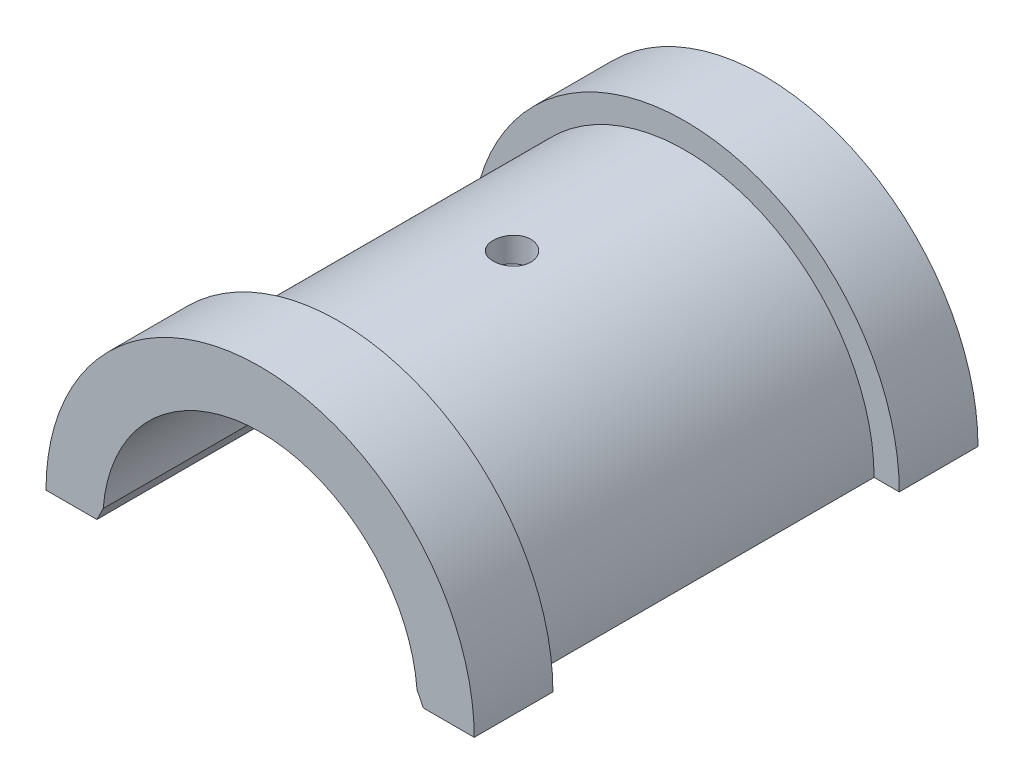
ISO-10303-21;
HEADER;
FILE_DESCRIPTION(('STEP AP214'),'2;1');
FILE_NAME('part.step','',(''),(''),'','','');
FILE_SCHEMA(('AUTOMOTIVE_DESIGN { 1 0 10303 214 1 1 1 1 }'));
ENDSEC;
DATA;
#1=APPLICATION_CONTEXT('core data for automotive mechanical design processes');
#2=APPLICATION_PROTOCOL_DEFINITION('international standard','automotive_design',2000,#1);
#3=PRODUCT_CONTEXT('',#1,'mechanical');
#4=PRODUCT('Part','Part','',(#3));
#5=PRODUCT_RELATED_PRODUCT_CATEGORY('part','',(#4));
#6=PRODUCT_DEFINITION_FORMATION('','',#4);
#7=PRODUCT_DEFINITION_CONTEXT('part definition',#1,'design');
#8=PRODUCT_DEFINITION('design','',#6,#7);
#9=PRODUCT_DEFINITION_SHAPE('','',#8);
#10=(LENGTH_UNIT() NAMED_UNIT(*) SI_UNIT(.MILLI.,.METRE.));
#11=(NAMED_UNIT(*) PLANE_ANGLE_UNIT() SI_UNIT($,.RADIAN.));
#12=(NAMED_UNIT(*) SI_UNIT($,.STERADIAN.) SOLID_ANGLE_UNIT());
#13=UNCERTAINTY_MEASURE_WITH_UNIT(LENGTH_MEASURE(1.E-05),#10,'distance_accuracy_value','');
#14=(GEOMETRIC_REPRESENTATION_CONTEXT(3) GLOBAL_UNCERTAINTY_ASSIGNED_CONTEXT((#13)) GLOBAL_UNIT_ASSIGNED_CONTEXT((#10,
#11,#12)) REPRESENTATION_CONTEXT('',''));
#15=CARTESIAN_POINT('',(0.,0.,0.));
#16=DIRECTION('',(0.,0.,1.));
#17=DIRECTION('',(1.,0.,0.));
#18=AXIS2_PLACEMENT_3D('',#15,#16,#17);
#19=CARTESIAN_POINT('',(0.,70.,40.));
#20=DIRECTION('',(0.,0.,-1.));
#21=DIRECTION('',(-1.,0.,0.));
#22=AXIS2_PLACEMENT_3D('',#19,#20,#21);
#23=CYLINDRICAL_SURFACE('',#22,25.);
#24=DIRECTION('',(0.,0.,1.));
#25=VECTOR('',#24,1.);
#26=CARTESIAN_POINT('',(24.9198715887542,72.,-40.));
#27=LINE('',#26,#25);
#28=CARTESIAN_POINT('',(24.9198715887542,72.,-40.));
#29=VERTEX_POINT('',#28);
#30=CARTESIAN_POINT('',(24.9198715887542,72.,40.));
#31=VERTEX_POINT('',#30);
#32=EDGE_CURVE('E51',#29,#31,#27,.T.);
#33=ORIENTED_EDGE('',*,*,#32,.T.);
#34=CARTESIAN_POINT('',(0.,70.,40.));
#35=DIRECTION('',(0.,0.,-1.));
#36=DIRECTION('',(-1.,0.,0.));
#37=AXIS2_PLACEMENT_3D('',#34,#35,#36);
#38=CIRCLE('',#37,25.);
#39=CARTESIAN_POINT('',(-24.9198715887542,72.,40.));
#40=VERTEX_POINT('',#39);
#41=EDGE_CURVE('E139',#40,#31,#38,.T.);
#42=ORIENTED_EDGE('',*,*,#41,.F.);
#43=DIRECTION('',(0.,0.,1.));
#44=VECTOR('',#43,1.);
#45=CARTESIAN_POINT('',(-24.9198715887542,72.,-40.));
#46=LINE('',#45,#44);
#47=CARTESIAN_POINT('',(-24.9198715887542,72.,-40.));
#48=VERTEX_POINT('',#47);
#49=EDGE_CURVE('E187',#48,#40,#46,.T.);
#50=ORIENTED_EDGE('',*,*,#49,.F.);
#51=CARTESIAN_POINT('',(0.,70.,-40.));
#52=DIRECTION('',(0.,0.,-1.));
#53=DIRECTION('',(-1.,0.,0.));
#54=AXIS2_PLACEMENT_3D('',#51,#52,#53);
#55=CIRCLE('',#54,25.);
#56=EDGE_CURVE('E136',#48,#29,#55,.T.);
#57=ORIENTED_EDGE('',*,*,#56,.T.);
#58=EDGE_LOOP('',(#33,#42,#50,#57));
#59=FACE_BOUND('',#58,.T.);
#60=ADVANCED_FACE('F31',(#59),#23,.F.);
#61=CARTESIAN_POINT('',(25.,70.,40.));
#62=DIRECTION('',(0.,1.,0.));
#63=DIRECTION('',(0.,0.,1.));
#64=AXIS2_PLACEMENT_3D('',#61,#62,#63);
#65=PLANE('',#64);
#66=DIRECTION('',(0.,0.,1.));
#67=VECTOR('',#66,1.);
#68=CARTESIAN_POINT('',(25.9198715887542,70.,-40.));
#69=LINE('',#68,#67);
#70=CARTESIAN_POINT('',(25.9198715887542,70.,-40.));
#71=VERTEX_POINT('',#70);
#72=CARTESIAN_POINT('',(25.9198715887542,70.,40.));
#73=VERTEX_POINT('',#72);
#74=EDGE_CURVE('E113',#71,#73,#69,.T.);
#75=ORIENTED_EDGE('',*,*,#74,.F.);
#76=DIRECTION('',(1.,0.,0.));
#77=VECTOR('',#76,1.);
#78=CARTESIAN_POINT('',(25.,70.,-40.));
#79=LINE('',#78,#77);
#80=CARTESIAN_POINT('',(34.,70.,-40.));
#81=VERTEX_POINT('',#80);
#82=EDGE_CURVE('E125',#71,#81,#79,.T.);
#83=ORIENTED_EDGE('',*,*,#82,.T.);
#84=DIRECTION('',(0.,0.,-1.));
#85=VECTOR('',#84,1.);
#86=CARTESIAN_POINT('',(34.,70.,48.5263112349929));
#87=LINE('',#86,#85);
#88=CARTESIAN_POINT('',(34.,70.,-27.5));
#89=VERTEX_POINT('',#88);
#90=EDGE_CURVE('E181',#89,#81,#87,.T.);
#91=ORIENTED_EDGE('',*,*,#90,.F.);
#92=DIRECTION('',(1.,0.,0.));
#93=VECTOR('',#92,1.);
#94=CARTESIAN_POINT('',(25.,70.,-27.5));
#95=LINE('',#94,#93);
#96=CARTESIAN_POINT('',(30.,70.,-27.5));
#97=VERTEX_POINT('',#96);
#98=EDGE_CURVE('E178',#97,#89,#95,.T.);
#99=ORIENTED_EDGE('',*,*,#98,.F.);
#100=DIRECTION('',(0.,0.,-1.));
#101=VECTOR('',#100,1.);
#102=CARTESIAN_POINT('',(30.,70.,40.));
#103=LINE('',#102,#101);
#104=CARTESIAN_POINT('',(30.,70.,27.5));
#105=VERTEX_POINT('',#104);
#106=EDGE_CURVE('E44',#105,#97,#103,.T.);
#107=ORIENTED_EDGE('',*,*,#106,.F.);
#108=DIRECTION('',(1.,0.,0.));
#109=VECTOR('',#108,1.);
#110=CARTESIAN_POINT('',(34.,70.,27.5));
#111=LINE('',#110,#109);
#112=CARTESIAN_POINT('',(34.,70.,27.5));
#113=VERTEX_POINT('',#112);
#114=EDGE_CURVE('E168',#105,#113,#111,.T.);
#115=ORIENTED_EDGE('',*,*,#114,.T.);
#116=DIRECTION('',(0.,0.,1.));
#117=VECTOR('',#116,1.);
#118=CARTESIAN_POINT('',(34.,70.,-48.5263112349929));
#119=LINE('',#118,#117);
#120=CARTESIAN_POINT('',(34.,70.,40.));
#121=VERTEX_POINT('',#120);
#122=EDGE_CURVE('E165',#113,#121,#119,.T.);
#123=ORIENTED_EDGE('',*,*,#122,.T.);
#124=DIRECTION('',(1.,0.,0.));
#125=VECTOR('',#124,1.);
#126=CARTESIAN_POINT('',(25.,70.,40.));
#127=LINE('',#126,#125);
#128=EDGE_CURVE('E128',#73,#121,#127,.T.);
#129=ORIENTED_EDGE('',*,*,#128,.F.);
#130=EDGE_LOOP('',(#75,#83,#91,#99,#107,#115,#123,#129));
#131=FACE_BOUND('',#130,.T.);
#132=ADVANCED_FACE('F123',(#131),#65,.F.);
#133=CARTESIAN_POINT('',(0.,70.,40.));
#134=DIRECTION('',(0.,0.,-1.));
#135=DIRECTION('',(-1.,0.,0.));
#136=AXIS2_PLACEMENT_3D('',#133,#134,#135);
#137=PLANE('',#136);
#138=DIRECTION('',(0.447213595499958,-0.894427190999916,0.));
#139=VECTOR('',#138,1.);
#140=CARTESIAN_POINT('',(24.9198715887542,72.,40.));
#141=LINE('',#140,#139);
#142=EDGE_CURVE('E119',#31,#73,#141,.T.);
#143=ORIENTED_EDGE('',*,*,#142,.T.);
#144=ORIENTED_EDGE('',*,*,#128,.T.);
#145=CARTESIAN_POINT('',(0.,70.,40.));
#146=DIRECTION('',(0.,0.,1.));
#147=DIRECTION('',(-1.,0.,0.));
#148=AXIS2_PLACEMENT_3D('',#145,#146,#147);
#149=CIRCLE('',#148,34.);
#150=CARTESIAN_POINT('',(-34.,70.,40.));
#151=VERTEX_POINT('',#150);
#152=EDGE_CURVE('E174',#121,#151,#149,.T.);
#153=ORIENTED_EDGE('',*,*,#152,.T.);
#154=DIRECTION('',(1.,0.,0.));
#155=VECTOR('',#154,1.);
#156=CARTESIAN_POINT('',(-30.,70.,40.));
#157=LINE('',#156,#155);
#158=CARTESIAN_POINT('',(-25.9198715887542,70.,40.));
#159=VERTEX_POINT('',#158);
#160=EDGE_CURVE('E135',#151,#159,#157,.T.);
#161=ORIENTED_EDGE('',*,*,#160,.T.);
#162=DIRECTION('',(-0.447213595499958,-0.894427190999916,0.));
#163=VECTOR('',#162,1.);
#164=CARTESIAN_POINT('',(-24.9198715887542,72.,40.));
#165=LINE('',#164,#163);
#166=EDGE_CURVE('E129',#40,#159,#165,.T.);
#167=ORIENTED_EDGE('',*,*,#166,.F.);
#168=ORIENTED_EDGE('',*,*,#41,.T.);
#169=EDGE_LOOP('',(#143,#144,#153,#161,#167,#168));
#170=FACE_BOUND('',#169,.T.);
#171=ADVANCED_FACE('F224',(#170),#137,.F.);
#172=CARTESIAN_POINT('',(0.,70.,-40.));
#173=DIRECTION('',(0.,0.,-1.));
#174=DIRECTION('',(-1.,0.,0.));
#175=AXIS2_PLACEMENT_3D('',#172,#173,#174);
#176=PLANE('',#175);
#177=ORIENTED_EDGE('',*,*,#82,.F.);
#178=DIRECTION('',(0.447213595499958,-0.894427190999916,0.));
#179=VECTOR('',#178,1.);
#180=CARTESIAN_POINT('',(24.9198715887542,72.,-40.));
#181=LINE('',#180,#179);
#182=EDGE_CURVE('E110',#29,#71,#181,.T.);
#183=ORIENTED_EDGE('',*,*,#182,.F.);
#184=ORIENTED_EDGE('',*,*,#56,.F.);
#185=DIRECTION('',(-0.447213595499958,-0.894427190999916,0.));
#186=VECTOR('',#185,1.);
#187=CARTESIAN_POINT('',(-24.9198715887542,72.,-40.));
#188=LINE('',#187,#186);
#189=CARTESIAN_POINT('',(-25.9198715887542,70.,-40.));
#190=VERTEX_POINT('',#189);
#191=EDGE_CURVE('E192',#48,#190,#188,.T.);
#192=ORIENTED_EDGE('',*,*,#191,.T.);
#193=DIRECTION('',(1.,0.,0.));
#194=VECTOR('',#193,1.);
#195=CARTESIAN_POINT('',(-30.,70.,-40.));
#196=LINE('',#195,#194);
#197=CARTESIAN_POINT('',(-34.,70.,-40.));
#198=VERTEX_POINT('',#197);
#199=EDGE_CURVE('E141',#198,#190,#196,.T.);
#200=ORIENTED_EDGE('',*,*,#199,.F.);
#201=CARTESIAN_POINT('',(0.,70.,-40.));
#202=DIRECTION('',(0.,0.,-1.));
#203=DIRECTION('',(-1.,0.,0.));
#204=AXIS2_PLACEMENT_3D('',#201,#202,#203);
#205=CIRCLE('',#204,34.);
#206=EDGE_CURVE('E134',#198,#81,#205,.T.);
#207=ORIENTED_EDGE('',*,*,#206,.T.);
#208=EDGE_LOOP('',(#177,#183,#184,#192,#200,#207));
#209=FACE_BOUND('',#208,.T.);
#210=ADVANCED_FACE('F132',(#209),#176,.T.);
#211=CARTESIAN_POINT('',(0.,70.,40.));
#212=DIRECTION('',(0.,0.,-1.));
#213=DIRECTION('',(-1.,0.,0.));
#214=AXIS2_PLACEMENT_3D('',#211,#212,#213);
#215=CYLINDRICAL_SURFACE('',#214,30.);
#216=CARTESIAN_POINT('',(-3.,99.8496231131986,0.));
#217=CARTESIAN_POINT('',(-2.99999272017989,99.8496250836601,-0.168058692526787));
#218=CARTESIAN_POINT('',(-2.98583057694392,99.8510577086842,-0.336228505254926));
#219=CARTESIAN_POINT('',(-2.92954894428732,99.856632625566,-0.667905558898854));
#220=CARTESIAN_POINT('',(-2.88739864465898,99.8607779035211,-0.831407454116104));
#221=CARTESIAN_POINT('',(-2.77638034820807,99.8713039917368,-1.14889745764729));
#222=CARTESIAN_POINT('',(-2.70752854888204,99.8776834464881,-1.3028912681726));
#223=CARTESIAN_POINT('',(-2.54509280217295,99.8919574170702,-1.59710337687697));
#224=CARTESIAN_POINT('',(-2.45151376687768,99.8998516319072,-1.73732440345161));
#225=CARTESIAN_POINT('',(-2.2419142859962,99.9162978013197,-2.00055379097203));
#226=CARTESIAN_POINT('',(-2.1258222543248,99.9248518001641,-2.12350502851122));
#227=CARTESIAN_POINT('',(-1.87464514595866,99.9416351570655,-2.34821282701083));
#228=CARTESIAN_POINT('',(-1.7395592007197,99.9498645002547,-2.44996841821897));
#229=CARTESIAN_POINT('',(-1.45387908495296,99.9650914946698,-2.62959377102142));
#230=CARTESIAN_POINT('',(-1.30325298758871,99.9720865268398,-2.70741299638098));
#231=CARTESIAN_POINT('',(-0.990989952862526,99.9840345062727,-2.83663329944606));
#232=CARTESIAN_POINT('',(-0.829353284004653,99.9889875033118,-2.88803502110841));
#233=CARTESIAN_POINT('',(-0.500234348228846,99.9962789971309,-2.96279372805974));
#234=CARTESIAN_POINT('',(-0.332773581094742,99.9986262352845,-2.98624449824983));
#235=CARTESIAN_POINT('',(0.0037222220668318,100.000471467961,-3.00472580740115));
#236=CARTESIAN_POINT('',(0.172757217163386,99.9999695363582,-2.99975708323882));
#237=CARTESIAN_POINT('',(0.506966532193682,99.9961801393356,-2.96161658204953));
#238=CARTESIAN_POINT('',(0.672152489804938,99.9929026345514,-2.92854565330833));
#239=CARTESIAN_POINT('',(0.9946175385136,99.9839418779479,-2.83529661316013));
#240=CARTESIAN_POINT('',(1.15189652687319,99.9782585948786,-2.77511814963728));
#241=CARTESIAN_POINT('',(1.45440094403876,99.9651081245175,-2.62925171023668));
#242=CARTESIAN_POINT('',(1.59960471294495,99.9576378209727,-2.54351910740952));
#243=CARTESIAN_POINT('',(1.87360053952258,99.9417515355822,-2.34901042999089));
#244=CARTESIAN_POINT('',(2.00239211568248,99.9333355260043,-2.24023367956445));
#245=CARTESIAN_POINT('',(2.24049831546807,99.9164588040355,-2.00215731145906));
#246=CARTESIAN_POINT('',(2.34972523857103,99.9079980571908,-1.87276996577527));
#247=CARTESIAN_POINT('',(2.54492260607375,99.8920221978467,-1.59744940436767));
#248=CARTESIAN_POINT('',(2.63089301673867,99.8845070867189,-1.45151616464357));
#249=CARTESIAN_POINT('',(2.77713655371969,99.8712726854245,-1.14717892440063));
#250=CARTESIAN_POINT('',(2.83740426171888,99.8655537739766,-0.988772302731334));
#251=CARTESIAN_POINT('',(2.93046220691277,99.8565670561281,-0.664018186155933));
#252=CARTESIAN_POINT('',(2.9632532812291,99.8532991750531,-0.497670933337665));
#253=CARTESIAN_POINT('',(3.00031432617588,99.8495974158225,-0.162527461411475));
#254=CARTESIAN_POINT('',(3.00470698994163,99.8491513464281,0.00625506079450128));
#255=CARTESIAN_POINT('',(2.98516874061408,99.8511115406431,0.34215379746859));
#256=CARTESIAN_POINT('',(2.96123821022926,99.8535177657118,0.509270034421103));
#257=CARTESIAN_POINT('',(2.88583552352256,99.8609003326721,0.836734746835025));
#258=CARTESIAN_POINT('',(2.83442138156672,99.8658712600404,0.997096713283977));
#259=CARTESIAN_POINT('',(2.70557015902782,99.8778187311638,1.30692015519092));
#260=CARTESIAN_POINT('',(2.62813248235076,99.8847953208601,1.45638138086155));
#261=CARTESIAN_POINT('',(2.44912500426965,99.8999975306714,1.74071992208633));
#262=CARTESIAN_POINT('',(2.34747389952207,99.9082273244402,1.87554582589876));
#263=CARTESIAN_POINT('',(2.12304160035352,99.9249949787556,2.12626515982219));
#264=CARTESIAN_POINT('',(2.0002598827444,99.933532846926,2.24215812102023));
#265=CARTESIAN_POINT('',(1.73651941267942,99.9499914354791,2.45214490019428));
#266=CARTESIAN_POINT('',(1.59549676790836,99.9579098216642,2.54615867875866));
#267=CARTESIAN_POINT('',(1.29959315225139,99.9722032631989,2.70916760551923));
#268=CARTESIAN_POINT('',(1.14471237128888,99.9785783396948,2.77816309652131));
#269=CARTESIAN_POINT('',(0.825768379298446,99.9890563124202,2.889041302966));
#270=CARTESIAN_POINT('',(0.661722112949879,99.9931632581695,2.93097236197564));
#271=CARTESIAN_POINT('',(0.328874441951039,99.9986588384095,2.98668920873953));
#272=CARTESIAN_POINT('',(0.160073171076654,100.000047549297,3.00047578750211));
#273=CARTESIAN_POINT('',(-0.176706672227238,99.9999501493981,2.99950120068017));
#274=CARTESIAN_POINT('',(-0.344685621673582,99.9984765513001,2.98486428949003));
#275=CARTESIAN_POINT('',(-0.675785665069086,99.9928448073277,2.92771876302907));
#276=CARTESIAN_POINT('',(-0.838906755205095,99.9886866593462,2.88521012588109));
#277=CARTESIAN_POINT('',(-1.15565972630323,99.9781517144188,2.7735622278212));
#278=CARTESIAN_POINT('',(-1.30929289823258,99.9717752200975,2.70442659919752));
#279=CARTESIAN_POINT('',(-1.60279380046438,99.9575143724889,2.54150049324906));
#280=CARTESIAN_POINT('',(-1.74266161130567,99.9496300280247,2.44771016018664));
#281=CARTESIAN_POINT('',(-2.00529817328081,99.9331955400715,2.23767114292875));
#282=CARTESIAN_POINT('',(-2.12799277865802,99.9246427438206,2.1213299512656));
#283=CARTESIAN_POINT('',(-2.35217327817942,99.9078577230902,1.86967394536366));
#284=CARTESIAN_POINT('',(-2.45365407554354,99.8996255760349,1.73435458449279));
#285=CARTESIAN_POINT('',(-2.63272992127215,99.8843915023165,1.44820697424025));
#286=CARTESIAN_POINT('',(-2.71026356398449,99.8773927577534,1.29734015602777));
#287=CARTESIAN_POINT('',(-2.83879412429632,99.8654558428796,0.984755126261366));
#288=CARTESIAN_POINT('',(-2.88982097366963,99.8605153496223,0.823049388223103));
#289=CARTESIAN_POINT('',(-2.95116506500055,99.8545002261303,0.550356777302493));
#290=CARTESIAN_POINT('',(-2.96945313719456,99.8526799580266,0.441113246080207));
#291=CARTESIAN_POINT('',(-2.99387297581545,99.8502407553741,0.221262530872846));
#292=CARTESIAN_POINT('',(-3.00000479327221,99.8496218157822,0.110655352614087));
#293=CARTESIAN_POINT('',(-3.,99.8496231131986,0.));
#294=B_SPLINE_CURVE_WITH_KNOTS('',3,(#216,#217,#218,#219,#220,#221,#222,#223,#224,#225,#226,
#227,#228,#229,#230,#231,#232,#233,#234,#235,#236,#237,#238,#239,#240,#241,#242,#243,#244,#245,
#246,#247,#248,#249,#250,#251,#252,#253,#254,#255,#256,#257,#258,#259,#260,#261,#262,#263,#264,
#265,#266,#267,#268,#269,#270,#271,#272,#273,#274,#275,#276,#277,#278,#279,#280,#281,#282,#283,
#284,#285,#286,#287,#288,#289,#290,#291,#292,#293),.UNSPECIFIED.,.T.,.F.,(4,2,2,2,2,2,2,2,2,2,2,
2,2,2,2,2,2,2,2,2,2,2,2,2,2,2,2,2,2,2,2,2,2,2,2,2,2,2,4),(0.,0.503771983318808,1.00809945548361,
1.51212147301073,2.01604344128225,2.52159484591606,3.02716937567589,3.53380409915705,
4.04042647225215,4.54534412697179,5.05024868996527,5.55334895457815,6.05645575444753,
6.56044636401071,7.06445175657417,7.57066275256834,8.07687448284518,8.58319287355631,
9.08949583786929,9.59360988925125,10.0977171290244,10.6007644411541,11.1038232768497,
11.6085956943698,12.1133806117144,12.6199841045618,13.1265806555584,13.6322697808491,
14.1379446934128,14.6414140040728,15.144883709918,15.6482847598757,16.1516828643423,
16.6571914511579,17.162821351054,17.6697372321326,18.1760794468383,18.5077808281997,
18.8394808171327),.UNSPECIFIED.);
#295=CARTESIAN_POINT('',(-3.,99.8496231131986,0.));
#296=VERTEX_POINT('',#295);
#297=EDGE_CURVE('E36',#296,#296,#294,.T.);
#298=ORIENTED_EDGE('',*,*,#297,.T.);
#299=EDGE_LOOP('',(#298));
#300=FACE_BOUND('',#299,.T.);
#301=CARTESIAN_POINT('',(0.,70.,-27.5));
#302=DIRECTION('',(0.,0.,-1.));
#303=DIRECTION('',(-1.,0.,0.));
#304=AXIS2_PLACEMENT_3D('',#301,#302,#303);
#305=CIRCLE('',#304,30.);
#306=CARTESIAN_POINT('',(-30.,70.,-27.5));
#307=VERTEX_POINT('',#306);
#308=EDGE_CURVE('E176',#307,#97,#305,.T.);
#309=ORIENTED_EDGE('',*,*,#308,.F.);
#310=DIRECTION('',(0.,0.,-1.));
#311=VECTOR('',#310,1.);
#312=CARTESIAN_POINT('',(-30.,70.,40.));
#313=LINE('',#312,#311);
#314=CARTESIAN_POINT('',(-30.,70.,27.5));
#315=VERTEX_POINT('',#314);
#316=EDGE_CURVE('E11',#315,#307,#313,.T.);
#317=ORIENTED_EDGE('',*,*,#316,.F.);
#318=CARTESIAN_POINT('',(0.,70.,27.5));
#319=DIRECTION('',(0.,0.,-1.));
#320=DIRECTION('',(-1.,0.,0.));
#321=AXIS2_PLACEMENT_3D('',#318,#319,#320);
#322=CIRCLE('',#321,30.);
#323=EDGE_CURVE('E155',#315,#105,#322,.T.);
#324=ORIENTED_EDGE('',*,*,#323,.T.);
#325=ORIENTED_EDGE('',*,*,#106,.T.);
#326=EDGE_LOOP('',(#309,#317,#324,#325));
#327=FACE_BOUND('',#326,.T.);
#328=ADVANCED_FACE('F33',(#300,#327),#215,.T.);
#329=CARTESIAN_POINT('',(-30.,70.,40.));
#330=DIRECTION('',(0.,1.,0.));
#331=DIRECTION('',(0.,0.,1.));
#332=AXIS2_PLACEMENT_3D('',#329,#330,#331);
#333=PLANE('',#332);
#334=ORIENTED_EDGE('',*,*,#199,.T.);
#335=DIRECTION('',(0.,0.,1.));
#336=VECTOR('',#335,1.);
#337=CARTESIAN_POINT('',(-25.9198715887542,70.,-40.));
#338=LINE('',#337,#336);
#339=EDGE_CURVE('E59',#190,#159,#338,.T.);
#340=ORIENTED_EDGE('',*,*,#339,.T.);
#341=ORIENTED_EDGE('',*,*,#160,.F.);
#342=DIRECTION('',(0.,0.,1.));
#343=VECTOR('',#342,1.);
#344=CARTESIAN_POINT('',(-34.,70.,-48.5263112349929));
#345=LINE('',#344,#343);
#346=CARTESIAN_POINT('',(-34.,70.,27.5));
#347=VERTEX_POINT('',#346);
#348=EDGE_CURVE('E162',#347,#151,#345,.T.);
#349=ORIENTED_EDGE('',*,*,#348,.F.);
#350=DIRECTION('',(1.,0.,0.));
#351=VECTOR('',#350,1.);
#352=CARTESIAN_POINT('',(-25.,70.,27.5));
#353=LINE('',#352,#351);
#354=EDGE_CURVE('E158',#347,#315,#353,.T.);
#355=ORIENTED_EDGE('',*,*,#354,.T.);
#356=ORIENTED_EDGE('',*,*,#316,.T.);
#357=DIRECTION('',(1.,0.,0.));
#358=VECTOR('',#357,1.);
#359=CARTESIAN_POINT('',(-34.,70.,-27.5));
#360=LINE('',#359,#358);
#361=CARTESIAN_POINT('',(-34.,70.,-27.5));
#362=VERTEX_POINT('',#361);
#363=EDGE_CURVE('E185',#362,#307,#360,.T.);
#364=ORIENTED_EDGE('',*,*,#363,.F.);
#365=DIRECTION('',(0.,0.,-1.));
#366=VECTOR('',#365,1.);
#367=CARTESIAN_POINT('',(-34.,70.,48.5263112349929));
#368=LINE('',#367,#366);
#369=EDGE_CURVE('E183',#362,#198,#368,.T.);
#370=ORIENTED_EDGE('',*,*,#369,.T.);
#371=EDGE_LOOP('',(#334,#340,#341,#349,#355,#356,#364,#370));
#372=FACE_BOUND('',#371,.T.);
#373=ADVANCED_FACE('F227',(#372),#333,.F.);
#374=CARTESIAN_POINT('',(0.,70.,27.5));
#375=DIRECTION('',(0.,0.,-1.));
#376=DIRECTION('',(-1.,0.,0.));
#377=AXIS2_PLACEMENT_3D('',#374,#375,#376);
#378=PLANE('',#377);
#379=ORIENTED_EDGE('',*,*,#323,.F.);
#380=ORIENTED_EDGE('',*,*,#354,.F.);
#381=CARTESIAN_POINT('',(0.,70.,27.5));
#382=DIRECTION('',(0.,0.,-1.));
#383=DIRECTION('',(-1.,0.,0.));
#384=AXIS2_PLACEMENT_3D('',#381,#382,#383);
#385=CIRCLE('',#384,34.);
#386=EDGE_CURVE('E167',#113,#347,#385,.F.);
#387=ORIENTED_EDGE('',*,*,#386,.F.);
#388=ORIENTED_EDGE('',*,*,#114,.F.);
#389=EDGE_LOOP('',(#379,#380,#387,#388));
#390=FACE_BOUND('',#389,.T.);
#391=ADVANCED_FACE('F229',(#390),#378,.T.);
#392=CARTESIAN_POINT('',(0.,70.,-48.5263112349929));
#393=DIRECTION('',(0.,0.,1.));
#394=DIRECTION('',(1.,0.,0.));
#395=AXIS2_PLACEMENT_3D('',#392,#393,#394);
#396=CYLINDRICAL_SURFACE('',#395,34.);
#397=ORIENTED_EDGE('',*,*,#122,.F.);
#398=ORIENTED_EDGE('',*,*,#386,.T.);
#399=ORIENTED_EDGE('',*,*,#348,.T.);
#400=ORIENTED_EDGE('',*,*,#152,.F.);
#401=EDGE_LOOP('',(#397,#398,#399,#400));
#402=FACE_BOUND('',#401,.T.);
#403=ADVANCED_FACE('F234',(#402),#396,.T.);
#404=CARTESIAN_POINT('',(0.,70.,-27.5));
#405=DIRECTION('',(0.,0.,-1.));
#406=DIRECTION('',(-1.,0.,0.));
#407=AXIS2_PLACEMENT_3D('',#404,#405,#406);
#408=PLANE('',#407);
#409=ORIENTED_EDGE('',*,*,#363,.T.);
#410=ORIENTED_EDGE('',*,*,#308,.T.);
#411=ORIENTED_EDGE('',*,*,#98,.T.);
#412=CARTESIAN_POINT('',(0.,70.,-27.5));
#413=DIRECTION('',(0.,0.,-1.));
#414=DIRECTION('',(-1.,0.,0.));
#415=AXIS2_PLACEMENT_3D('',#412,#413,#414);
#416=CIRCLE('',#415,34.);
#417=EDGE_CURVE('E180',#89,#362,#416,.F.);
#418=ORIENTED_EDGE('',*,*,#417,.T.);
#419=EDGE_LOOP('',(#409,#410,#411,#418));
#420=FACE_BOUND('',#419,.T.);
#421=ADVANCED_FACE('F247',(#420),#408,.F.);
#422=CARTESIAN_POINT('',(0.,70.,48.5263112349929));
#423=DIRECTION('',(0.,0.,-1.));
#424=DIRECTION('',(-1.,0.,0.));
#425=AXIS2_PLACEMENT_3D('',#422,#423,#424);
#426=CYLINDRICAL_SURFACE('',#425,34.);
#427=ORIENTED_EDGE('',*,*,#417,.F.);
#428=ORIENTED_EDGE('',*,*,#90,.T.);
#429=ORIENTED_EDGE('',*,*,#206,.F.);
#430=ORIENTED_EDGE('',*,*,#369,.F.);
#431=EDGE_LOOP('',(#427,#428,#429,#430));
#432=FACE_BOUND('',#431,.T.);
#433=ADVANCED_FACE('F249',(#432),#426,.T.);
#434=CARTESIAN_POINT('',(-24.9198715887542,72.,-40.));
#435=DIRECTION('',(-0.894427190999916,0.447213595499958,0.));
#436=DIRECTION('',(-0.447213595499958,-0.894427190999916,0.));
#437=AXIS2_PLACEMENT_3D('',#434,#435,#436);
#438=PLANE('',#437);
#439=ORIENTED_EDGE('',*,*,#166,.T.);
#440=ORIENTED_EDGE('',*,*,#339,.F.);
#441=ORIENTED_EDGE('',*,*,#191,.F.);
#442=ORIENTED_EDGE('',*,*,#49,.T.);
#443=EDGE_LOOP('',(#439,#440,#441,#442));
#444=FACE_BOUND('',#443,.T.);
#445=ADVANCED_FACE('F215',(#444),#438,.F.);
#446=CARTESIAN_POINT('',(24.9198715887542,72.,-40.));
#447=DIRECTION('',(-0.894427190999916,-0.447213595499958,0.));
#448=DIRECTION('',(0.447213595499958,-0.894427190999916,0.));
#449=AXIS2_PLACEMENT_3D('',#446,#447,#448);
#450=PLANE('',#449);
#451=ORIENTED_EDGE('',*,*,#142,.F.);
#452=ORIENTED_EDGE('',*,*,#32,.F.);
#453=ORIENTED_EDGE('',*,*,#182,.T.);
#454=ORIENTED_EDGE('',*,*,#74,.T.);
#455=EDGE_LOOP('',(#451,#452,#453,#454));
#456=FACE_BOUND('',#455,.T.);
#457=ADVANCED_FACE('F112',(#456),#450,.T.);
#458=CARTESIAN_POINT('',(0.,120.528811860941,0.));
#459=DIRECTION('',(0.,1.,0.));
#460=DIRECTION('',(-1.,0.,0.));
#461=AXIS2_PLACEMENT_3D('',#458,#459,#460);
#462=CYLINDRICAL_SURFACE('',#461,3.);
#463=CARTESIAN_POINT('',(0.,96.,0.));
#464=DIRECTION('',(0.,1.,0.));
#465=DIRECTION('',(-1.,0.,0.));
#466=AXIS2_PLACEMENT_3D('',#463,#464,#465);
#467=CIRCLE('',#466,3.);
#468=CARTESIAN_POINT('',(-3.,96.,0.));
#469=VERTEX_POINT('',#468);
#470=EDGE_CURVE('E198',#469,#469,#467,.T.);
#471=ORIENTED_EDGE('',*,*,#470,.F.);
#472=EDGE_LOOP('',(#471));
#473=FACE_BOUND('',#472,.T.);
#474=ORIENTED_EDGE('',*,*,#297,.F.);
#475=EDGE_LOOP('',(#474));
#476=FACE_BOUND('',#475,.T.);
#477=ADVANCED_FACE('F206',(#473,#476),#462,.F.);
#478=CARTESIAN_POINT('',(0.,96.,0.));
#479=DIRECTION('',(0.,-1.,0.));
#480=DIRECTION('',(1.,0.,0.));
#481=AXIS2_PLACEMENT_3D('',#478,#479,#480);
#482=PLANE('',#481);
#483=ORIENTED_EDGE('',*,*,#470,.T.);
#484=EDGE_LOOP('',(#483));
#485=FACE_BOUND('',#484,.T.);
#486=ADVANCED_FACE('F208',(#485),#482,.F.);
#487=CLOSED_SHELL('',(#60,#132,#171,#210,#328,#373,#391,#403,#421,#433,#445,#457,#477,#486));
#488=MANIFOLD_SOLID_BREP('B2',#487);
#489=ADVANCED_BREP_SHAPE_REPRESENTATION('',(#18,#488),#14);
#490=SHAPE_DEFINITION_REPRESENTATION(#9,#489);
ENDSEC;
END-ISO-10303-21;
